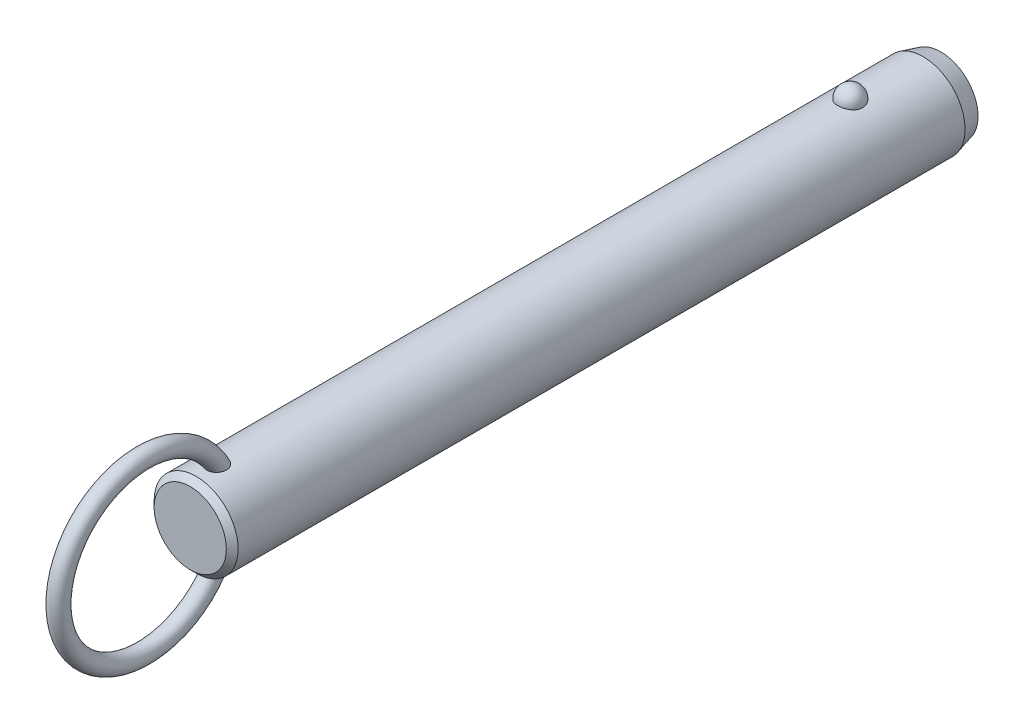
ISO-10303-21;
HEADER;
FILE_DESCRIPTION(('STEP AP214'),'2;1');
FILE_NAME('part.step','',(''),(''),'','','');
FILE_SCHEMA(('AUTOMOTIVE_DESIGN { 1 0 10303 214 1 1 1 1 }'));
ENDSEC;
DATA;
#1=APPLICATION_CONTEXT('core data for automotive mechanical design processes');
#2=APPLICATION_PROTOCOL_DEFINITION('international standard','automotive_design',2000,#1);
#3=PRODUCT_CONTEXT('',#1,'mechanical');
#4=PRODUCT('Part','Part','',(#3));
#5=PRODUCT_RELATED_PRODUCT_CATEGORY('part','',(#4));
#6=PRODUCT_DEFINITION_FORMATION('','',#4);
#7=PRODUCT_DEFINITION_CONTEXT('part definition',#1,'design');
#8=PRODUCT_DEFINITION('design','',#6,#7);
#9=PRODUCT_DEFINITION_SHAPE('','',#8);
#10=(LENGTH_UNIT() NAMED_UNIT(*) SI_UNIT(.MILLI.,.METRE.));
#11=(NAMED_UNIT(*) PLANE_ANGLE_UNIT() SI_UNIT($,.RADIAN.));
#12=(NAMED_UNIT(*) SI_UNIT($,.STERADIAN.) SOLID_ANGLE_UNIT());
#13=UNCERTAINTY_MEASURE_WITH_UNIT(LENGTH_MEASURE(1.E-05),#10,'distance_accuracy_value','');
#14=(GEOMETRIC_REPRESENTATION_CONTEXT(3) GLOBAL_UNCERTAINTY_ASSIGNED_CONTEXT((#13)) GLOBAL_UNIT_ASSIGNED_CONTEXT((#10,
#11,#12)) REPRESENTATION_CONTEXT('',''));
#15=CARTESIAN_POINT('',(0.,0.,0.));
#16=DIRECTION('',(0.,0.,1.));
#17=DIRECTION('',(1.,0.,0.));
#18=AXIS2_PLACEMENT_3D('',#15,#16,#17);
#19=CARTESIAN_POINT('',(0.,0.,101.6));
#20=DIRECTION('',(0.,0.,-1.));
#21=DIRECTION('',(-1.,0.,0.));
#22=AXIS2_PLACEMENT_3D('',#19,#20,#21);
#23=CYLINDRICAL_SURFACE('',#22,7.1);
#24=CARTESIAN_POINT('',(2.0769088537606,6.78943661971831,-2.1));
#25=CARTESIAN_POINT('',(2.07690739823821,6.78943796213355,-1.98268154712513));
#26=CARTESIAN_POINT('',(2.06738130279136,6.79237331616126,-1.86534506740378));
#27=CARTESIAN_POINT('',(2.0295040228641,6.8037853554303,-1.63400788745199));
#28=CARTESIAN_POINT('',(2.00114757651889,6.81226358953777,-1.52000812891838));
#29=CARTESIAN_POINT('',(1.92632025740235,6.83379798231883,-1.29863433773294));
#30=CARTESIAN_POINT('',(1.87985726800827,6.84685214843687,-1.19125744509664));
#31=CARTESIAN_POINT('',(1.76995205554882,6.87608091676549,-0.98604657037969));
#32=CARTESIAN_POINT('',(1.70650980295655,6.8922555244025,-0.88821260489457));
#33=CARTESIAN_POINT('',(1.5638119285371,6.92602930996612,-0.704242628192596));
#34=CARTESIAN_POINT('',(1.4844714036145,6.94363582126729,-0.618173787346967));
#35=CARTESIAN_POINT('',(1.31221746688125,6.97823658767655,-0.460740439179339));
#36=CARTESIAN_POINT('',(1.21930409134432,6.99523084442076,-0.389375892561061));
#37=CARTESIAN_POINT('',(1.02268781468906,7.02666176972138,-0.263547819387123));
#38=CARTESIAN_POINT('',(0.91902009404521,7.04110638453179,-0.209031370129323));
#39=CARTESIAN_POINT('',(0.703548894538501,7.06588726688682,-0.118163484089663));
#40=CARTESIAN_POINT('',(0.591746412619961,7.07622403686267,-0.0818098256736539));
#41=CARTESIAN_POINT('',(0.365557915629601,7.09147068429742,-0.0288711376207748));
#42=CARTESIAN_POINT('',(0.251267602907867,7.09648447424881,-0.0119070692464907));
#43=CARTESIAN_POINT('',(0.0213499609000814,7.10089837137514,0.00304925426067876));
#44=CARTESIAN_POINT('',(-0.0942772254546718,7.10029907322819,0.00104351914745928));
#45=CARTESIAN_POINT('',(-0.321651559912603,7.09360829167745,-0.0216931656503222));
#46=CARTESIAN_POINT('',(-0.433431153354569,7.08760388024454,-0.0421272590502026));
#47=CARTESIAN_POINT('',(-0.651862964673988,7.07086131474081,-0.100729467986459));
#48=CARTESIAN_POINT('',(-0.758515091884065,7.06012307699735,-0.138897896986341));
#49=CARTESIAN_POINT('',(-0.964449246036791,7.03496097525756,-0.232213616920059));
#50=CARTESIAN_POINT('',(-1.06368095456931,7.02051445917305,-0.287465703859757));
#51=CARTESIAN_POINT('',(-1.25145353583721,6.98948740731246,-0.413383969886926));
#52=CARTESIAN_POINT('',(-1.33999321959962,6.97290663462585,-0.48405186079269));
#53=CARTESIAN_POINT('',(-1.50591604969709,6.93898770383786,-0.640594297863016));
#54=CARTESIAN_POINT('',(-1.58302488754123,6.92164094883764,-0.726757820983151));
#55=CARTESIAN_POINT('',(-1.72189320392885,6.8884103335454,-0.91092752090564));
#56=CARTESIAN_POINT('',(-1.78365144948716,6.87252659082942,-1.008934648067));
#57=CARTESIAN_POINT('',(-1.89101272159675,6.84377189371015,-1.21549497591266));
#58=CARTESIAN_POINT('',(-1.93639553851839,6.83094274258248,-1.32416860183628));
#59=CARTESIAN_POINT('',(-2.00874275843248,6.81002070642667,-1.54791500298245));
#60=CARTESIAN_POINT('',(-2.03570774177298,6.80192767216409,-1.66298757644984));
#61=CARTESIAN_POINT('',(-2.07047276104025,6.7914266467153,-1.89571453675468));
#62=CARTESIAN_POINT('',(-2.07835878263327,6.78899315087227,-2.01335491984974));
#63=CARTESIAN_POINT('',(-2.07502083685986,6.79001409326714,-2.24833570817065));
#64=CARTESIAN_POINT('',(-2.06379746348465,6.7934683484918,-2.36567612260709));
#65=CARTESIAN_POINT('',(-2.02263913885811,6.80583442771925,-2.59603194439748));
#66=CARTESIAN_POINT('',(-1.99281127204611,6.81471501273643,-2.70906820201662));
#67=CARTESIAN_POINT('',(-1.91526639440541,6.83691232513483,-2.92836575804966));
#68=CARTESIAN_POINT('',(-1.8675486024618,6.85022924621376,-3.03462676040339));
#69=CARTESIAN_POINT('',(-1.75504492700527,6.87991336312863,-3.23806487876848));
#70=CARTESIAN_POINT('',(-1.69015924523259,6.89629822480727,-3.33518422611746));
#71=CARTESIAN_POINT('',(-1.54505404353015,6.93024852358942,-3.51697105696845));
#72=CARTESIAN_POINT('',(-1.46483385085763,6.94781401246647,-3.60163799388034));
#73=CARTESIAN_POINT('',(-1.29071406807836,6.98225977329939,-3.75654119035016));
#74=CARTESIAN_POINT('',(-1.19675650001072,6.99913673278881,-3.82671308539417));
#75=CARTESIAN_POINT('',(-0.997940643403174,7.03023618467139,-3.9501837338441));
#76=CARTESIAN_POINT('',(-0.89308318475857,7.04445887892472,-4.00348377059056));
#77=CARTESIAN_POINT('',(-0.676902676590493,7.06848365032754,-4.09107242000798));
#78=CARTESIAN_POINT('',(-0.565686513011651,7.0783430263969,-4.12560889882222));
#79=CARTESIAN_POINT('',(-0.338739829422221,7.09282534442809,-4.17575450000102));
#80=CARTESIAN_POINT('',(-0.223009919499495,7.09744899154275,-4.19136617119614));
#81=CARTESIAN_POINT('',(0.00707628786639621,7.10090930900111,-4.20307965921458));
#82=CARTESIAN_POINT('',(0.121410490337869,7.09986531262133,-4.19958377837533));
#83=CARTESIAN_POINT('',(0.347815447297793,7.092380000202,-4.17411564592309));
#84=CARTESIAN_POINT('',(0.459886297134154,7.08593891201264,-4.15214417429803));
#85=CARTESIAN_POINT('',(0.678084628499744,7.06838983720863,-4.09049562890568));
#86=CARTESIAN_POINT('',(0.784237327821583,7.05730369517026,-4.05090137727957));
#87=CARTESIAN_POINT('',(0.988305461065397,7.03163139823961,-3.95511447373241));
#88=CARTESIAN_POINT('',(1.08622031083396,7.01704499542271,-3.89892064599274));
#89=CARTESIAN_POINT('',(1.27284490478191,6.98562668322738,-3.77035541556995));
#90=CARTESIAN_POINT('',(1.36137372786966,6.96876135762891,-3.69772964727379));
#91=CARTESIAN_POINT('',(1.52509486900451,6.93477412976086,-3.53878279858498));
#92=CARTESIAN_POINT('',(1.60028496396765,6.91765218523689,-3.45245943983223));
#93=CARTESIAN_POINT('',(1.73681688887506,6.88465753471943,-3.26658774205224));
#94=CARTESIAN_POINT('',(1.79785966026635,6.86881574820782,-3.16681408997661));
#95=CARTESIAN_POINT('',(1.90265327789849,6.84053157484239,-2.95814408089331));
#96=CARTESIAN_POINT('',(1.94640861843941,6.82808830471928,-2.84925010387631));
#97=CARTESIAN_POINT('',(2.01274378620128,6.80881460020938,-2.63454318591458));
#98=CARTESIAN_POINT('',(2.03676193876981,6.80160856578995,-2.52920574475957));
#99=CARTESIAN_POINT('',(2.06884490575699,6.79191902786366,-2.3159172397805));
#100=CARTESIAN_POINT('',(2.07691019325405,6.78943538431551,-2.20796625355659));
#101=CARTESIAN_POINT('',(2.0769088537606,6.78943661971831,-2.1));
#102=B_SPLINE_CURVE_WITH_KNOTS('',3,(#24,#25,#26,#27,#28,#29,#30,#31,#32,#33,#34,#35,#36,#37,
#38,#39,#40,#41,#42,#43,#44,#45,#46,#47,#48,#49,#50,#51,#52,#53,#54,#55,#56,#57,#58,#59,#60,#61,
#62,#63,#64,#65,#66,#67,#68,#69,#70,#71,#72,#73,#74,#75,#76,#77,#78,#79,#80,#81,#82,#83,#84,#85,
#86,#87,#88,#89,#90,#91,#92,#93,#94,#95,#96,#97,#98,#99,#100,#101),.UNSPECIFIED.,.T.,.F.,(4,2,2,
2,2,2,2,2,2,2,2,2,2,2,2,2,2,2,2,2,2,2,2,2,2,2,2,2,2,2,2,2,2,2,2,2,2,2,4),(0.,0.351568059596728,
0.703234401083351,1.05474780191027,1.40626181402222,1.75970563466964,2.11314851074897,
2.4654696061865,2.81774759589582,3.16301449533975,3.50824481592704,3.84801136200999,
4.18778391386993,4.52968352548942,4.87162112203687,5.22076181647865,5.56993054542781,
5.92363364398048,6.27732559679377,6.62942052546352,6.98150450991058,7.33158042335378,
7.68167162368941,8.03384443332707,8.38603269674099,8.73975272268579,9.09344583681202,
9.44234545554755,9.79119807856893,10.1327344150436,10.4742563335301,10.8141898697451,
11.1541474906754,11.4997793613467,11.8454687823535,12.1979079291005,12.5502553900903,
12.8738073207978,13.1973496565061),.UNSPECIFIED.);
#103=CARTESIAN_POINT('',(2.0769088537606,6.78943661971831,-2.1));
#104=VERTEX_POINT('',#103);
#105=EDGE_CURVE('E41',#104,#104,#102,.T.);
#106=ORIENTED_EDGE('',*,*,#105,.T.);
#107=EDGE_LOOP('',(#106));
#108=FACE_BOUND('',#107,.T.);
#109=CARTESIAN_POINT('',(0.,0.,108.52));
#110=DIRECTION('',(0.,0.,1.));
#111=DIRECTION('',(1.,0.,0.));
#112=AXIS2_PLACEMENT_3D('',#109,#110,#111);
#113=CIRCLE('',#112,7.1);
#114=CARTESIAN_POINT('',(7.1,0.,108.52));
#115=VERTEX_POINT('',#114);
#116=EDGE_CURVE('E10',#115,#115,#113,.F.);
#117=ORIENTED_EDGE('',*,*,#116,.T.);
#118=EDGE_LOOP('',(#117));
#119=FACE_BOUND('',#118,.T.);
#120=CARTESIAN_POINT('',(-0.429539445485,-7.08699541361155,103.342921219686));
#121=CARTESIAN_POINT('',(-0.508331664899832,-7.08221999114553,103.366876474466));
#122=CARTESIAN_POINT('',(-0.58503984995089,-7.07624016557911,103.397457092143));
#123=CARTESIAN_POINT('',(-0.732082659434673,-7.06254296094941,103.471024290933));
#124=CARTESIAN_POINT('',(-0.802417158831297,-7.05482554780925,103.514011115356));
#125=CARTESIAN_POINT('',(-0.934722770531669,-7.03851844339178,103.611113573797));
#126=CARTESIAN_POINT('',(-0.99670020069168,-7.02992941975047,103.665220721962));
#127=CARTESIAN_POINT('',(-1.11079942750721,-7.01280697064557,103.782967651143));
#128=CARTESIAN_POINT('',(-1.16292136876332,-7.00427354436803,103.846607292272));
#129=CARTESIAN_POINT('',(-1.25705660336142,-6.98799959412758,103.982687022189));
#130=CARTESIAN_POINT('',(-1.29888032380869,-6.98027525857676,104.055259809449));
#131=CARTESIAN_POINT('',(-1.37069920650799,-6.96652886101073,104.206168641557));
#132=CARTESIAN_POINT('',(-1.40069157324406,-6.96050720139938,104.284506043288));
#133=CARTESIAN_POINT('',(-1.45043507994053,-6.95031881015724,104.450190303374));
#134=CARTESIAN_POINT('',(-1.46937115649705,-6.94630231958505,104.537789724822));
#135=CARTESIAN_POINT('',(-1.49424917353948,-6.94099239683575,104.714871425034));
#136=CARTESIAN_POINT('',(-1.50018601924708,-6.93970003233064,104.804354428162));
#137=CARTESIAN_POINT('',(-1.49978214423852,-6.93978815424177,104.994060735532));
#138=CARTESIAN_POINT('',(-1.49187639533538,-6.94150934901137,105.094279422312));
#139=CARTESIAN_POINT('',(-1.46177925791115,-6.94790814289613,105.292479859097));
#140=CARTESIAN_POINT('',(-1.43957541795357,-6.95258831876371,105.390459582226));
#141=CARTESIAN_POINT('',(-1.37783293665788,-6.96510647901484,105.59536292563));
#142=CARTESIAN_POINT('',(-1.33634073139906,-6.97328848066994,105.701680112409));
#143=CARTESIAN_POINT('',(-1.23686994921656,-6.99161706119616,105.906177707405));
#144=CARTESIAN_POINT('',(-1.17889192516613,-7.00176357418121,106.004358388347));
#145=CARTESIAN_POINT('',(-1.0587512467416,-7.02082898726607,106.172374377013));
#146=CARTESIAN_POINT('',(-0.999247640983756,-7.02963746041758,106.244123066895));
#147=CARTESIAN_POINT('',(-0.869494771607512,-7.04686074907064,106.377195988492));
#148=CARTESIAN_POINT('',(-0.799263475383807,-7.05527619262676,106.438537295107));
#149=CARTESIAN_POINT('',(-0.665408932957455,-7.06899457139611,106.535131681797));
#150=CARTESIAN_POINT('',(-0.603817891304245,-7.07457275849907,106.573151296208));
#151=CARTESIAN_POINT('',(-0.47517283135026,-7.08437420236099,106.638758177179));
#152=CARTESIAN_POINT('',(-0.408123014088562,-7.08859848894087,106.666353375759));
#153=CARTESIAN_POINT('',(-0.269431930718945,-7.09522749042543,106.709256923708));
#154=CARTESIAN_POINT('',(-0.197757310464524,-7.09761688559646,106.724461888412));
#155=CARTESIAN_POINT('',(-0.0527849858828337,-7.10017268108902,106.740716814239));
#156=CARTESIAN_POINT('',(0.0205115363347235,-7.10034065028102,106.741776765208));
#157=CARTESIAN_POINT('',(0.156426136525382,-7.09855986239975,106.730461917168));
#158=CARTESIAN_POINT('',(0.219199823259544,-7.09688191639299,106.719806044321));
#159=CARTESIAN_POINT('',(0.342134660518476,-7.09201880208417,106.688537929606));
#160=CARTESIAN_POINT('',(0.402295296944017,-7.08883333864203,106.667923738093));
#161=CARTESIAN_POINT('',(0.520687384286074,-7.08113868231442,106.617212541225));
#162=CARTESIAN_POINT('',(0.578791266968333,-7.07658958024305,106.586827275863));
#163=CARTESIAN_POINT('',(0.690173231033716,-7.06659708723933,106.518367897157));
#164=CARTESIAN_POINT('',(0.743447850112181,-7.061153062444,106.480288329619));
#165=CARTESIAN_POINT('',(0.870947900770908,-7.04680292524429,106.376592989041));
#166=CARTESIAN_POINT('',(0.941828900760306,-7.0375580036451,106.306897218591));
#167=CARTESIAN_POINT('',(1.07136606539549,-7.01900793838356,106.156945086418));
#168=CARTESIAN_POINT('',(1.13000013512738,-7.00970271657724,106.076670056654));
#169=CARTESIAN_POINT('',(1.23579584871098,-6.99183327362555,105.906899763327));
#170=CARTESIAN_POINT('',(1.2827427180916,-6.98328455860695,105.817269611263));
#171=CARTESIAN_POINT('',(1.36351442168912,-6.96796352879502,105.632176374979));
#172=CARTESIAN_POINT('',(1.39733971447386,-6.96119115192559,105.536713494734));
#173=CARTESIAN_POINT('',(1.45579181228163,-6.94922464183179,105.32530928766));
#174=CARTESIAN_POINT('',(1.47790145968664,-6.94449000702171,105.208631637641));
#175=CARTESIAN_POINT('',(1.50168752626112,-6.93938731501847,104.973015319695));
#176=CARTESIAN_POINT('',(1.50336085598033,-6.93901991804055,104.85407631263));
#177=CARTESIAN_POINT('',(1.48486516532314,-6.9430010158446,104.62360799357));
#178=CARTESIAN_POINT('',(1.46573441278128,-6.9471253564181,104.511995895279));
#179=CARTESIAN_POINT('',(1.40606892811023,-6.95944667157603,104.294886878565));
#180=CARTESIAN_POINT('',(1.36556446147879,-6.96763788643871,104.1893815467));
#181=CARTESIAN_POINT('',(1.27082700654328,-6.98548038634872,104.004287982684));
#182=CARTESIAN_POINT('',(1.21949810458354,-6.99473841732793,103.923171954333));
#183=CARTESIAN_POINT('',(1.10242050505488,-7.01414069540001,103.772227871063));
#184=CARTESIAN_POINT('',(1.03668119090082,-7.02428436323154,103.70239252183));
#185=CARTESIAN_POINT('',(0.900559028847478,-7.04295285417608,103.583573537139));
#186=CARTESIAN_POINT('',(0.83142884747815,-7.05153466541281,103.533157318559));
#187=CARTESIAN_POINT('',(0.68529187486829,-7.06723150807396,103.445142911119));
#188=CARTESIAN_POINT('',(0.608287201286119,-7.0743469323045,103.407541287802));
#189=CARTESIAN_POINT('',(0.451878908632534,-7.08602232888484,103.347491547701));
#190=CARTESIAN_POINT('',(0.372686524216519,-7.09067127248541,103.324508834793));
#191=CARTESIAN_POINT('',(0.211477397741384,-7.09730788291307,103.292035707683));
#192=CARTESIAN_POINT('',(0.129460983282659,-7.09929585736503,103.28254373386));
#193=CARTESIAN_POINT('',(-0.0332905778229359,-7.10037858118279,103.277351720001));
#194=CARTESIAN_POINT('',(-0.114016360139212,-7.09953334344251,103.281365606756));
#195=CARTESIAN_POINT('',(-0.273670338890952,-7.09517338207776,103.302454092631));
#196=CARTESIAN_POINT('',(-0.352598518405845,-7.09165863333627,103.319528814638));
#197=CARTESIAN_POINT('',(-0.429539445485,-7.08699541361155,103.342921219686));
#198=B_SPLINE_CURVE_WITH_KNOTS('',3,(#120,#121,#122,#123,#124,#125,#126,#127,#128,#129,#130,
#131,#132,#133,#134,#135,#136,#137,#138,#139,#140,#141,#142,#143,#144,#145,#146,#147,#148,#149,
#150,#151,#152,#153,#154,#155,#156,#157,#158,#159,#160,#161,#162,#163,#164,#165,#166,#167,#168,
#169,#170,#171,#172,#173,#174,#175,#176,#177,#178,#179,#180,#181,#182,#183,#184,#185,#186,#187,
#188,#189,#190,#191,#192,#193,#194,#195,#196,#197),.UNSPECIFIED.,.T.,.F.,(4,2,2,2,2,2,2,2,2,2,2,
2,2,2,2,2,2,2,2,2,2,2,2,2,2,2,2,2,2,2,2,2,2,2,2,2,2,2,4),(0.,0.247183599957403,
0.494372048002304,0.741372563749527,0.988369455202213,1.23962059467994,1.49093106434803,
1.75897818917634,2.02713035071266,2.32758265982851,2.62829697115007,2.97008736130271,
3.31186629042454,3.59175319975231,3.87117637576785,4.08813841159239,4.30493502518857,
4.52352259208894,4.74195577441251,4.9321532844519,5.12238804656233,5.31884850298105,
5.51544871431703,5.81332317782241,6.11173048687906,6.4152726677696,6.71880423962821,
7.07358156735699,7.42841252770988,7.76631485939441,8.10373999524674,8.39142246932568,
8.67891817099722,8.93560332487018,9.19221962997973,9.43881106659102,9.68537399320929,
9.92674752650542,10.1681233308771),.UNSPECIFIED.);
#199=CARTESIAN_POINT('',(-0.429539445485,-7.08699541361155,103.342921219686));
#200=VERTEX_POINT('',#199);
#201=EDGE_CURVE('E59',#200,#200,#198,.T.);
#202=ORIENTED_EDGE('',*,*,#201,.T.);
#203=EDGE_LOOP('',(#202));
#204=FACE_BOUND('',#203,.T.);
#205=CARTESIAN_POINT('',(-0.429539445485,7.08699541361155,103.342921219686));
#206=CARTESIAN_POINT('',(-0.351665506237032,7.09171429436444,103.319246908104));
#207=CARTESIAN_POINT('',(-0.271733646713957,7.09525896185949,103.302036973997));
#208=CARTESIAN_POINT('',(-0.110026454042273,7.09960839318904,103.281005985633));
#209=CARTESIAN_POINT('',(-0.028250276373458,7.10041187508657,103.277191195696));
#210=CARTESIAN_POINT('',(0.134782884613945,7.09918849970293,103.283059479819));
#211=CARTESIAN_POINT('',(0.21603995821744,7.09716214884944,103.29274013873));
#212=CARTESIAN_POINT('',(0.375730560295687,7.09050177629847,103.325347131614));
#213=CARTESIAN_POINT('',(0.454164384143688,7.08586802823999,103.348272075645));
#214=CARTESIAN_POINT('',(0.60602533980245,7.07449911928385,103.406771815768));
#215=CARTESIAN_POINT('',(0.679451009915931,7.06776334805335,103.442350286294));
#216=CARTESIAN_POINT('',(0.819234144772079,7.05292866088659,103.525175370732));
#217=CARTESIAN_POINT('',(0.88559181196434,7.04482978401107,103.572421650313));
#218=CARTESIAN_POINT('',(1.00993211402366,7.02808709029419,103.677590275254));
#219=CARTESIAN_POINT('',(1.06785399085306,7.01943990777,103.735583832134));
#220=CARTESIAN_POINT('',(1.17342527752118,7.00256662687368,103.860301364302));
#221=CARTESIAN_POINT('',(1.22107408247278,6.99434055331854,103.927025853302));
#222=CARTESIAN_POINT('',(1.30652927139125,6.97889183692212,104.069362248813));
#223=CARTESIAN_POINT('',(1.34399711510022,6.97170674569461,104.145180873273));
#224=CARTESIAN_POINT('',(1.40682616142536,6.95930080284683,104.301810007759));
#225=CARTESIAN_POINT('',(1.43218374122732,6.95408053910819,104.38262200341));
#226=CARTESIAN_POINT('',(1.47246409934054,6.94566853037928,104.553531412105));
#227=CARTESIAN_POINT('',(1.48642590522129,6.9426653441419,104.64386307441));
#228=CARTESIAN_POINT('',(1.5011410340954,6.93949744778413,104.825619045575));
#229=CARTESIAN_POINT('',(1.50188917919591,6.93933385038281,104.917043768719));
#230=CARTESIAN_POINT('',(1.49030464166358,6.94183245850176,105.11084381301));
#231=CARTESIAN_POINT('',(1.47627413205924,6.94486147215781,105.213112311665));
#232=CARTESIAN_POINT('',(1.43356351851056,6.95380194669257,105.414471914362));
#233=CARTESIAN_POINT('',(1.4048676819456,6.95971650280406,105.513559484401));
#234=CARTESIAN_POINT('',(1.32908750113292,6.97461208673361,105.718908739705));
#235=CARTESIAN_POINT('',(1.28011435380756,6.98388945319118,105.824456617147));
#236=CARTESIAN_POINT('',(1.16520357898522,7.00397743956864,106.025760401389));
#237=CARTESIAN_POINT('',(1.09927694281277,7.01478706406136,106.121522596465));
#238=CARTESIAN_POINT('',(0.969361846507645,7.03373936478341,106.276756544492));
#239=CARTESIAN_POINT('',(0.909042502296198,7.04187023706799,106.339303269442));
#240=CARTESIAN_POINT('',(0.77917855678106,7.0574173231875,106.454053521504));
#241=CARTESIAN_POINT('',(0.70964977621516,7.06483472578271,106.506274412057));
#242=CARTESIAN_POINT('',(0.576854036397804,7.0767751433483,106.588113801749));
#243=CARTESIAN_POINT('',(0.515118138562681,7.08158033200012,106.620164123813));
#244=CARTESIAN_POINT('',(0.387127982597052,7.08972701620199,106.673765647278));
#245=CARTESIAN_POINT('',(0.320877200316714,7.09306962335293,106.695324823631));
#246=CARTESIAN_POINT('',(0.185041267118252,7.09791507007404,106.726400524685));
#247=CARTESIAN_POINT('',(0.115437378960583,7.09940591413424,106.735838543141));
#248=CARTESIAN_POINT('',(-0.0243157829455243,7.10030171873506,106.741522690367));
#249=CARTESIAN_POINT('',(-0.0944648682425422,7.0997073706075,106.737773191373));
#250=CARTESIAN_POINT('',(-0.225713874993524,7.09668414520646,106.718508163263));
#251=CARTESIAN_POINT('',(-0.287006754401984,7.09444865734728,106.704232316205));
#252=CARTESIAN_POINT('',(-0.40655537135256,7.08860360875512,106.666368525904));
#253=CARTESIAN_POINT('',(-0.46480981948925,7.08499346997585,106.642776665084));
#254=CARTESIAN_POINT('',(-0.594955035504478,7.07541654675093,106.578923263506));
#255=CARTESIAN_POINT('',(-0.665389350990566,7.06906574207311,106.535753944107));
#256=CARTESIAN_POINT('',(-0.798242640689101,7.05530261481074,106.438587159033));
#257=CARTESIAN_POINT('',(-0.860645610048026,7.0478882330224,106.384568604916));
#258=CARTESIAN_POINT('',(-0.994249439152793,7.03045217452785,106.250996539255));
#259=CARTESIAN_POINT('',(-1.06260129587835,7.02030745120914,106.168614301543));
#260=CARTESIAN_POINT('',(-1.18502045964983,7.00068382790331,105.993843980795));
#261=CARTESIAN_POINT('',(-1.23907684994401,6.99120544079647,105.901448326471));
#262=CARTESIAN_POINT('',(-1.33335589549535,6.97384343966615,105.708008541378));
#263=CARTESIAN_POINT('',(-1.3733613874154,6.96598557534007,105.606856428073));
#264=CARTESIAN_POINT('',(-1.43770677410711,6.9529905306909,105.399504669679));
#265=CARTESIAN_POINT('',(-1.46204473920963,6.94785368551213,105.29330440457));
#266=CARTESIAN_POINT('',(-1.49537533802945,6.94076296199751,105.068231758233));
#267=CARTESIAN_POINT('',(-1.50273564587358,6.93914842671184,104.94909751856));
#268=CARTESIAN_POINT('',(-1.4954555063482,6.94072368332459,104.711470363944));
#269=CARTESIAN_POINT('',(-1.48082914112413,6.94391040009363,104.592977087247));
#270=CARTESIAN_POINT('',(-1.43076401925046,6.95438579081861,104.373432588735));
#271=CARTESIAN_POINT('',(-1.39762227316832,6.96121852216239,104.271841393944));
#272=CARTESIAN_POINT('',(-1.31211274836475,6.97783941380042,104.077351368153));
#273=CARTESIAN_POINT('',(-1.2597660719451,6.98762432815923,103.98444313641));
#274=CARTESIAN_POINT('',(-1.14583073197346,7.00713153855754,103.824160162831));
#275=CARTESIAN_POINT('',(-1.0866594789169,7.01665982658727,103.755035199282));
#276=CARTESIAN_POINT('',(-0.956606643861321,7.03556646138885,103.628878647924));
#277=CARTESIAN_POINT('',(-0.88573712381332,7.04494495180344,103.571834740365));
#278=CARTESIAN_POINT('',(-0.75155804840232,7.06035735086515,103.483100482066));
#279=CARTESIAN_POINT('',(-0.690120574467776,7.0666695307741,103.448593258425));
#280=CARTESIAN_POINT('',(-0.562815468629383,7.07794609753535,103.388750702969));
#281=CARTESIAN_POINT('',(-0.496948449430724,7.08291067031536,103.363414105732));
#282=CARTESIAN_POINT('',(-0.429539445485,7.08699541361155,103.342921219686));
#283=B_SPLINE_CURVE_WITH_KNOTS('',3,(#205,#206,#207,#208,#209,#210,#211,#212,#213,#214,#215,
#216,#217,#218,#219,#220,#221,#222,#223,#224,#225,#226,#227,#228,#229,#230,#231,#232,#233,#234,
#235,#236,#237,#238,#239,#240,#241,#242,#243,#244,#245,#246,#247,#248,#249,#250,#251,#252,#253,
#254,#255,#256,#257,#258,#259,#260,#261,#262,#263,#264,#265,#266,#267,#268,#269,#270,#271,#272,
#273,#274,#275,#276,#277,#278,#279,#280,#281,#282),.UNSPECIFIED.,.T.,.F.,(4,2,2,2,2,2,2,2,2,2,2,
2,2,2,2,2,2,2,2,2,2,2,2,2,2,2,2,2,2,2,2,2,2,2,2,2,2,2,4),(0.,0.244335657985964,
0.488785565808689,0.733191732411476,0.977572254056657,1.22202379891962,1.46646834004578,
1.71259457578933,1.95873529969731,2.21226768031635,2.46587585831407,2.7391381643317,
3.01250754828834,3.32109936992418,3.63002293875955,3.97863512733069,4.32702187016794,
4.5879394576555,4.84841449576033,5.05676704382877,5.26496096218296,5.47449661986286,
5.68396281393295,5.87205447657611,6.06022532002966,6.30743751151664,6.55513496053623,
6.87602468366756,7.19715875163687,7.52305774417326,7.84899686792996,8.20516155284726,
8.56109821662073,8.88040084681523,9.19935367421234,9.47236282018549,9.74509220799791,
9.9566225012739,10.1681235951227),.UNSPECIFIED.);
#284=CARTESIAN_POINT('',(-0.429539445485,7.08699541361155,103.342921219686));
#285=VERTEX_POINT('',#284);
#286=EDGE_CURVE('E67',#285,#285,#283,.T.);
#287=ORIENTED_EDGE('',*,*,#286,.T.);
#288=EDGE_LOOP('',(#287));
#289=FACE_BOUND('',#288,.T.);
#290=CARTESIAN_POINT('',(0.,0.,-14.3999999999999));
#291=DIRECTION('',(0.,0.,-1.));
#292=DIRECTION('',(-1.,0.,0.));
#293=AXIS2_PLACEMENT_3D('',#290,#291,#292);
#294=CIRCLE('',#293,7.1);
#295=CARTESIAN_POINT('',(-7.1,0.,-14.3999999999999));
#296=VERTEX_POINT('',#295);
#297=EDGE_CURVE('E56',#296,#296,#294,.F.);
#298=ORIENTED_EDGE('',*,*,#297,.T.);
#299=EDGE_LOOP('',(#298));
#300=FACE_BOUND('',#299,.T.);
#301=ADVANCED_FACE('F37',(#108,#119,#204,#289,#300),#23,.T.);
#302=CARTESIAN_POINT('',(0.,0.,-17.4));
#303=DIRECTION('',(0.,0.,-1.));
#304=DIRECTION('',(-1.,0.,0.));
#305=AXIS2_PLACEMENT_3D('',#302,#303,#304);
#306=PLANE('',#305);
#307=CARTESIAN_POINT('',(0.,0.,-17.4));
#308=DIRECTION('',(0.,0.,-1.));
#309=DIRECTION('',(-1.,0.,0.));
#310=AXIS2_PLACEMENT_3D('',#307,#308,#309);
#311=CIRCLE('',#310,6.29615242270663);
#312=CARTESIAN_POINT('',(-6.29615242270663,0.,-17.4));
#313=VERTEX_POINT('',#312);
#314=EDGE_CURVE('E66',#313,#313,#311,.T.);
#315=ORIENTED_EDGE('',*,*,#314,.T.);
#316=EDGE_LOOP('',(#315));
#317=FACE_BOUND('',#316,.T.);
#318=ADVANCED_FACE('F85',(#317),#306,.T.);
#319=CARTESIAN_POINT('',(0.,0.,-17.4));
#320=DIRECTION('',(0.,0.,1.));
#321=DIRECTION('',(1.,0.,0.));
#322=AXIS2_PLACEMENT_3D('',#319,#320,#321);
#323=CONICAL_SURFACE('',#322,6.29615242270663,0.261799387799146);
#324=ORIENTED_EDGE('',*,*,#297,.F.);
#325=EDGE_LOOP('',(#324));
#326=FACE_BOUND('',#325,.T.);
#327=ORIENTED_EDGE('',*,*,#314,.F.);
#328=EDGE_LOOP('',(#327));
#329=FACE_BOUND('',#328,.T.);
#330=ADVANCED_FACE('F83',(#326,#329),#323,.T.);
#331=CARTESIAN_POINT('',(0.,0.,109.52));
#332=DIRECTION('',(0.,0.,1.));
#333=DIRECTION('',(1.,0.,0.));
#334=AXIS2_PLACEMENT_3D('',#331,#332,#333);
#335=PLANE('',#334);
#336=CARTESIAN_POINT('',(0.,0.,109.52));
#337=DIRECTION('',(0.,0.,1.));
#338=DIRECTION('',(1.,0.,0.));
#339=AXIS2_PLACEMENT_3D('',#336,#337,#338);
#340=CIRCLE('',#339,6.10000000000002);
#341=CARTESIAN_POINT('',(6.10000000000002,0.,109.52));
#342=VERTEX_POINT('',#341);
#343=EDGE_CURVE('E50',#342,#342,#340,.T.);
#344=ORIENTED_EDGE('',*,*,#343,.T.);
#345=EDGE_LOOP('',(#344));
#346=FACE_BOUND('',#345,.T.);
#347=ADVANCED_FACE('F77',(#346),#335,.T.);
#348=CARTESIAN_POINT('',(0.,0.,117.45));
#349=DIRECTION('',(1.,0.,0.));
#350=DIRECTION('',(0.,0.,-1.));
#351=AXIS2_PLACEMENT_3D('',#348,#349,#350);
#352=TOROIDAL_SURFACE('',#351,14.35,1.5);
#353=ORIENTED_EDGE('',*,*,#286,.F.);
#354=EDGE_LOOP('',(#353));
#355=FACE_BOUND('',#354,.T.);
#356=ORIENTED_EDGE('',*,*,#201,.F.);
#357=EDGE_LOOP('',(#356));
#358=FACE_BOUND('',#357,.T.);
#359=ADVANCED_FACE('F73',(#355,#358),#352,.T.);
#360=CARTESIAN_POINT('',(0.,0.,109.52));
#361=DIRECTION('',(0.,0.,-1.));
#362=DIRECTION('',(-1.,0.,0.));
#363=AXIS2_PLACEMENT_3D('',#360,#361,#362);
#364=CONICAL_SURFACE('',#363,6.10000000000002,0.785398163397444);
#365=ORIENTED_EDGE('',*,*,#116,.F.);
#366=EDGE_LOOP('',(#365));
#367=FACE_BOUND('',#366,.T.);
#368=ORIENTED_EDGE('',*,*,#343,.F.);
#369=EDGE_LOOP('',(#368));
#370=FACE_BOUND('',#369,.T.);
#371=ADVANCED_FACE('F39',(#367,#370),#364,.T.);
#372=CARTESIAN_POINT('',(0.,7.1,-2.1));
#373=DIRECTION('',(0.,1.,0.));
#374=DIRECTION('',(0.,0.,1.));
#375=AXIS2_PLACEMENT_3D('',#372,#373,#374);
#376=SPHERICAL_SURFACE('',#375,2.10000000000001);
#377=ORIENTED_EDGE('',*,*,#105,.F.);
#378=EDGE_LOOP('',(#377));
#379=FACE_BOUND('',#378,.T.);
#380=ADVANCED_FACE('F79',(#379),#376,.T.);
#381=CLOSED_SHELL('',(#301,#318,#330,#347,#359,#371,#380));
#382=MANIFOLD_SOLID_BREP('B2',#381);
#383=ADVANCED_BREP_SHAPE_REPRESENTATION('',(#18,#382),#14);
#384=SHAPE_DEFINITION_REPRESENTATION(#9,#383);
ENDSEC;
END-ISO-10303-21;
